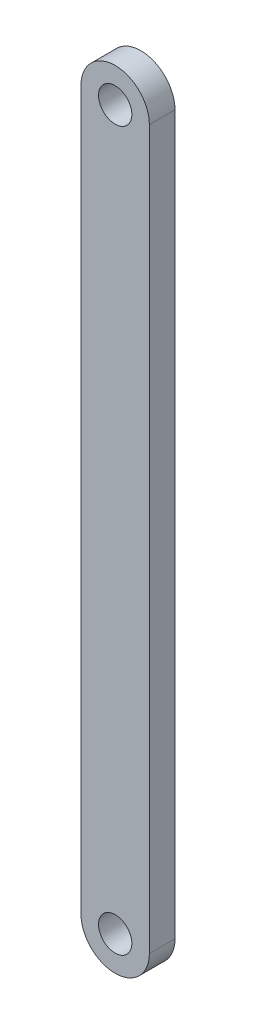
from build123d import *

# Parameters (mm, degrees)
EXTRUDE_1_DEPTH         = 3
HOLE_WIZARD_3_9_3_9_1_D = 3.9


with BuildPart() as part:
    # Sketch 1 → Extrude 1 (new body)
    with BuildSketch(Plane.XY):
        with BuildLine():
            Line((-4, 0), (-4, 84))
            ThreePointArc((-4, 84), (0, 88), (4, 84))
            Line((4, 84), (4, 0))
            ThreePointArc((4, 0), (0, -4), (-4, 0))
        make_face()
    extrude(amount=EXTRUDE_1_DEPTH)

    # Hole Wizard 3.9 _3.9_ _1 (through all)
    with Locations(Plane.XY.offset(3)):
        with Locations((0, 84), (0, 0)):
            Hole(HOLE_WIZARD_3_9_3_9_1_D / 2)


solid = part.part
